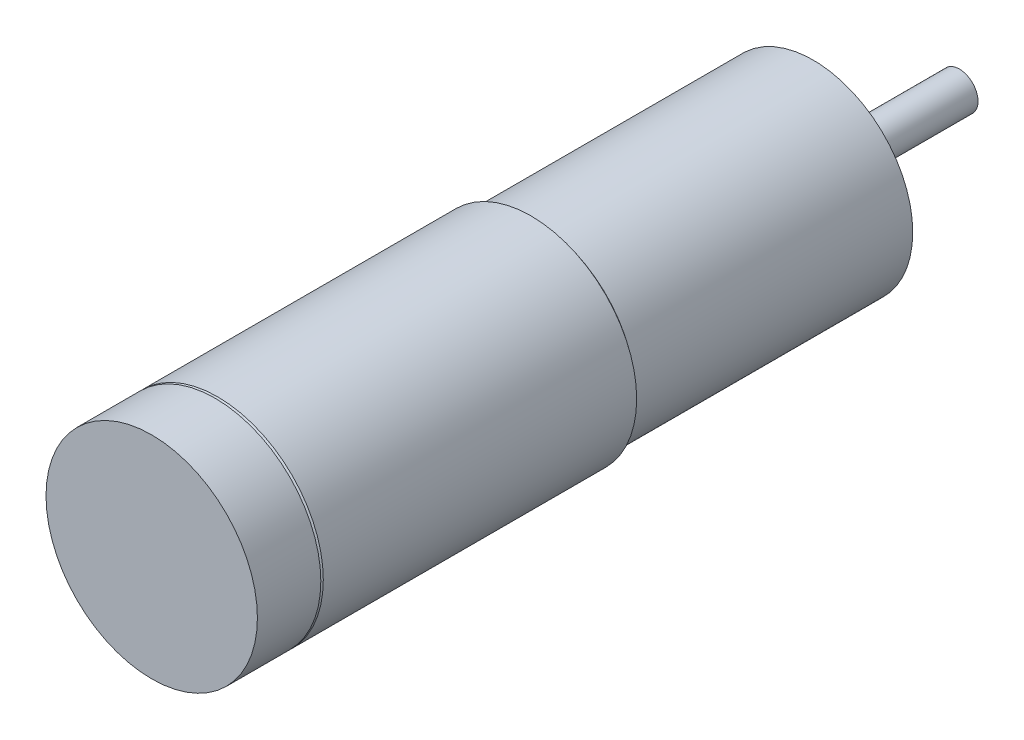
ISO-10303-21;
HEADER;
FILE_DESCRIPTION(('STEP AP214'),'2;1');
FILE_NAME('part.step','',(''),(''),'','','');
FILE_SCHEMA(('AUTOMOTIVE_DESIGN { 1 0 10303 214 1 1 1 1 }'));
ENDSEC;
DATA;
#1=APPLICATION_CONTEXT('core data for automotive mechanical design processes');
#2=APPLICATION_PROTOCOL_DEFINITION('international standard','automotive_design',2000,#1);
#3=PRODUCT_CONTEXT('',#1,'mechanical');
#4=PRODUCT('Part','Part','',(#3));
#5=PRODUCT_RELATED_PRODUCT_CATEGORY('part','',(#4));
#6=PRODUCT_DEFINITION_FORMATION('','',#4);
#7=PRODUCT_DEFINITION_CONTEXT('part definition',#1,'design');
#8=PRODUCT_DEFINITION('design','',#6,#7);
#9=PRODUCT_DEFINITION_SHAPE('','',#8);
#10=(LENGTH_UNIT() NAMED_UNIT(*) SI_UNIT(.MILLI.,.METRE.));
#11=(NAMED_UNIT(*) PLANE_ANGLE_UNIT() SI_UNIT($,.RADIAN.));
#12=(NAMED_UNIT(*) SI_UNIT($,.STERADIAN.) SOLID_ANGLE_UNIT());
#13=UNCERTAINTY_MEASURE_WITH_UNIT(LENGTH_MEASURE(1.E-05),#10,'distance_accuracy_value','');
#14=(GEOMETRIC_REPRESENTATION_CONTEXT(3) GLOBAL_UNCERTAINTY_ASSIGNED_CONTEXT((#13)) GLOBAL_UNIT_ASSIGNED_CONTEXT((#10,
#11,#12)) REPRESENTATION_CONTEXT('',''));
#15=CARTESIAN_POINT('',(0.,0.,0.));
#16=DIRECTION('',(0.,0.,1.));
#17=DIRECTION('',(1.,0.,0.));
#18=AXIS2_PLACEMENT_3D('',#15,#16,#17);
#19=CARTESIAN_POINT('',(0.,0.,-2.6));
#20=DIRECTION('',(0.,0.,-1.));
#21=DIRECTION('',(-1.,0.,0.));
#22=AXIS2_PLACEMENT_3D('',#19,#20,#21);
#23=PLANE('',#22);
#24=CARTESIAN_POINT('',(0.,0.,-2.6));
#25=DIRECTION('',(0.,0.,-1.));
#26=DIRECTION('',(-1.,0.,0.));
#27=AXIS2_PLACEMENT_3D('',#24,#25,#26);
#28=CIRCLE('',#27,3.);
#29=CARTESIAN_POINT('',(-3.,0.,-2.6));
#30=VERTEX_POINT('',#29);
#31=EDGE_CURVE('E78',#30,#30,#28,.T.);
#32=ORIENTED_EDGE('',*,*,#31,.T.);
#33=EDGE_LOOP('',(#32));
#34=FACE_BOUND('',#33,.T.);
#35=CARTESIAN_POINT('',(0.,0.,-2.6));
#36=DIRECTION('',(0.,0.,-1.));
#37=DIRECTION('',(-1.,0.,0.));
#38=AXIS2_PLACEMENT_3D('',#35,#36,#37);
#39=CIRCLE('',#38,1.5);
#40=CARTESIAN_POINT('',(-1.5,0.,-2.6));
#41=VERTEX_POINT('',#40);
#42=EDGE_CURVE('E77',#41,#41,#39,.F.);
#43=ORIENTED_EDGE('',*,*,#42,.T.);
#44=EDGE_LOOP('',(#43));
#45=FACE_BOUND('',#44,.T.);
#46=ADVANCED_FACE('F34',(#34,#45),#23,.T.);
#47=CARTESIAN_POINT('',(0.,0.,0.));
#48=DIRECTION('',(0.,0.,1.));
#49=DIRECTION('',(1.,0.,0.));
#50=AXIS2_PLACEMENT_3D('',#47,#48,#49);
#51=PLANE('',#50);
#52=CARTESIAN_POINT('',(0.,5.,0.));
#53=DIRECTION('',(0.,0.,-1.));
#54=DIRECTION('',(-1.,0.,0.));
#55=AXIS2_PLACEMENT_3D('',#52,#53,#54);
#56=CIRCLE('',#55,0.79999999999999);
#57=CARTESIAN_POINT('',(-0.79999999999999,5.,0.));
#58=VERTEX_POINT('',#57);
#59=EDGE_CURVE('E57',#58,#58,#56,.T.);
#60=ORIENTED_EDGE('',*,*,#59,.F.);
#61=EDGE_LOOP('',(#60));
#62=FACE_BOUND('',#61,.T.);
#63=CARTESIAN_POINT('',(0.,-5.,0.));
#64=DIRECTION('',(0.,0.,-1.));
#65=DIRECTION('',(-1.,0.,0.));
#66=AXIS2_PLACEMENT_3D('',#63,#64,#65);
#67=CIRCLE('',#66,0.79999999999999);
#68=CARTESIAN_POINT('',(-0.79999999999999,-5.,0.));
#69=VERTEX_POINT('',#68);
#70=EDGE_CURVE('E65',#69,#69,#67,.T.);
#71=ORIENTED_EDGE('',*,*,#70,.F.);
#72=EDGE_LOOP('',(#71));
#73=FACE_BOUND('',#72,.T.);
#74=CARTESIAN_POINT('',(0.,0.,0.));
#75=DIRECTION('',(0.,0.,1.));
#76=DIRECTION('',(1.,0.,0.));
#77=AXIS2_PLACEMENT_3D('',#74,#75,#76);
#78=CIRCLE('',#77,8.);
#79=CARTESIAN_POINT('',(8.,0.,0.));
#80=VERTEX_POINT('',#79);
#81=EDGE_CURVE('E84',#80,#80,#78,.T.);
#82=ORIENTED_EDGE('',*,*,#81,.F.);
#83=EDGE_LOOP('',(#82));
#84=FACE_BOUND('',#83,.T.);
#85=CARTESIAN_POINT('',(0.,0.,0.));
#86=DIRECTION('',(0.,0.,1.));
#87=DIRECTION('',(1.,0.,0.));
#88=AXIS2_PLACEMENT_3D('',#85,#86,#87);
#89=CIRCLE('',#88,3.);
#90=CARTESIAN_POINT('',(3.,0.,0.));
#91=VERTEX_POINT('',#90);
#92=EDGE_CURVE('E93',#91,#91,#89,.F.);
#93=ORIENTED_EDGE('',*,*,#92,.F.);
#94=EDGE_LOOP('',(#93));
#95=FACE_BOUND('',#94,.T.);
#96=ADVANCED_FACE('F121',(#62,#73,#84,#95),#51,.F.);
#97=CARTESIAN_POINT('',(0.,0.,22.7));
#98=DIRECTION('',(0.,0.,-1.));
#99=DIRECTION('',(-1.,0.,0.));
#100=AXIS2_PLACEMENT_3D('',#97,#98,#99);
#101=CYLINDRICAL_SURFACE('',#100,8.);
#102=CARTESIAN_POINT('',(0.,0.,22.319));
#103=DIRECTION('',(0.,0.,1.));
#104=DIRECTION('',(1.,0.,0.));
#105=AXIS2_PLACEMENT_3D('',#102,#103,#104);
#106=CIRCLE('',#105,8.);
#107=CARTESIAN_POINT('',(8.,0.,22.319));
#108=VERTEX_POINT('',#107);
#109=EDGE_CURVE('E90',#108,#108,#106,.F.);
#110=ORIENTED_EDGE('',*,*,#109,.T.);
#111=EDGE_LOOP('',(#110));
#112=FACE_BOUND('',#111,.T.);
#113=ORIENTED_EDGE('',*,*,#81,.T.);
#114=EDGE_LOOP('',(#113));
#115=FACE_BOUND('',#114,.T.);
#116=ADVANCED_FACE('F36',(#112,#115),#101,.T.);
#117=CARTESIAN_POINT('',(0.,0.,22.7));
#118=DIRECTION('',(0.,0.,-1.));
#119=DIRECTION('',(-1.,0.,0.));
#120=AXIS2_PLACEMENT_3D('',#117,#118,#119);
#121=CONICAL_SURFACE('',#120,7.619,0.785398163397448);
#122=ORIENTED_EDGE('',*,*,#109,.F.);
#123=EDGE_LOOP('',(#122));
#124=FACE_BOUND('',#123,.T.);
#125=CARTESIAN_POINT('',(0.,0.,22.7));
#126=DIRECTION('',(0.,0.,1.));
#127=DIRECTION('',(1.,0.,0.));
#128=AXIS2_PLACEMENT_3D('',#125,#126,#127);
#129=CIRCLE('',#128,7.619);
#130=CARTESIAN_POINT('',(7.619,0.,22.7));
#131=VERTEX_POINT('',#130);
#132=EDGE_CURVE('E87',#131,#131,#129,.T.);
#133=ORIENTED_EDGE('',*,*,#132,.F.);
#134=EDGE_LOOP('',(#133));
#135=FACE_BOUND('',#134,.T.);
#136=ADVANCED_FACE('F142',(#124,#135),#121,.T.);
#137=CARTESIAN_POINT('',(0.,0.,48.1));
#138=DIRECTION('',(0.,0.,-1.));
#139=DIRECTION('',(-1.,0.,0.));
#140=AXIS2_PLACEMENT_3D('',#137,#138,#139);
#141=CYLINDRICAL_SURFACE('',#140,8.5);
#142=CARTESIAN_POINT('',(0.,0.,47.9));
#143=DIRECTION('',(0.,0.,1.));
#144=DIRECTION('',(1.,0.,0.));
#145=AXIS2_PLACEMENT_3D('',#142,#143,#144);
#146=CIRCLE('',#145,8.5);
#147=CARTESIAN_POINT('',(8.5,0.,47.9));
#148=VERTEX_POINT('',#147);
#149=EDGE_CURVE('E11',#148,#148,#146,.F.);
#150=ORIENTED_EDGE('',*,*,#149,.T.);
#151=EDGE_LOOP('',(#150));
#152=FACE_BOUND('',#151,.T.);
#153=CARTESIAN_POINT('',(0.,0.,22.7));
#154=DIRECTION('',(0.,0.,1.));
#155=DIRECTION('',(1.,0.,0.));
#156=AXIS2_PLACEMENT_3D('',#153,#154,#155);
#157=CIRCLE('',#156,8.5);
#158=CARTESIAN_POINT('',(8.5,0.,22.7));
#159=VERTEX_POINT('',#158);
#160=EDGE_CURVE('E81',#159,#159,#157,.T.);
#161=ORIENTED_EDGE('',*,*,#160,.T.);
#162=EDGE_LOOP('',(#161));
#163=FACE_BOUND('',#162,.T.);
#164=ADVANCED_FACE('F138',(#152,#163),#141,.T.);
#165=CARTESIAN_POINT('',(0.,0.,22.7));
#166=DIRECTION('',(0.,0.,1.));
#167=DIRECTION('',(1.,0.,0.));
#168=AXIS2_PLACEMENT_3D('',#165,#166,#167);
#169=PLANE('',#168);
#170=ORIENTED_EDGE('',*,*,#132,.T.);
#171=EDGE_LOOP('',(#170));
#172=FACE_BOUND('',#171,.T.);
#173=ORIENTED_EDGE('',*,*,#160,.F.);
#174=EDGE_LOOP('',(#173));
#175=FACE_BOUND('',#174,.T.);
#176=ADVANCED_FACE('F134',(#172,#175),#169,.F.);
#177=CARTESIAN_POINT('',(0.,0.,-2.6));
#178=DIRECTION('',(0.,0.,1.));
#179=DIRECTION('',(1.,0.,0.));
#180=AXIS2_PLACEMENT_3D('',#177,#178,#179);
#181=CYLINDRICAL_SURFACE('',#180,3.);
#182=ORIENTED_EDGE('',*,*,#31,.F.);
#183=EDGE_LOOP('',(#182));
#184=FACE_BOUND('',#183,.T.);
#185=ORIENTED_EDGE('',*,*,#92,.T.);
#186=EDGE_LOOP('',(#185));
#187=FACE_BOUND('',#186,.T.);
#188=ADVANCED_FACE('F131',(#184,#187),#181,.T.);
#189=CARTESIAN_POINT('',(0.,0.,-11.75));
#190=DIRECTION('',(0.,0.,1.));
#191=DIRECTION('',(1.,0.,0.));
#192=AXIS2_PLACEMENT_3D('',#189,#190,#191);
#193=CYLINDRICAL_SURFACE('',#192,1.5);
#194=ORIENTED_EDGE('',*,*,#42,.F.);
#195=EDGE_LOOP('',(#194));
#196=FACE_BOUND('',#195,.T.);
#197=CARTESIAN_POINT('',(0.,0.,-11.75));
#198=DIRECTION('',(0.,0.,-1.));
#199=DIRECTION('',(-1.,0.,0.));
#200=AXIS2_PLACEMENT_3D('',#197,#198,#199);
#201=CIRCLE('',#200,1.5);
#202=CARTESIAN_POINT('',(-1.5,0.,-11.75));
#203=VERTEX_POINT('',#202);
#204=EDGE_CURVE('E74',#203,#203,#201,.T.);
#205=ORIENTED_EDGE('',*,*,#204,.F.);
#206=EDGE_LOOP('',(#205));
#207=FACE_BOUND('',#206,.T.);
#208=ADVANCED_FACE('F116',(#196,#207),#193,.T.);
#209=CARTESIAN_POINT('',(0.,0.,-11.75));
#210=DIRECTION('',(0.,0.,-1.));
#211=DIRECTION('',(-1.,0.,0.));
#212=AXIS2_PLACEMENT_3D('',#209,#210,#211);
#213=PLANE('',#212);
#214=ORIENTED_EDGE('',*,*,#204,.T.);
#215=EDGE_LOOP('',(#214));
#216=FACE_BOUND('',#215,.T.);
#217=ADVANCED_FACE('F106',(#216),#213,.T.);
#218=CARTESIAN_POINT('',(0.,0.,48.1));
#219=DIRECTION('',(0.,0.,-1.));
#220=DIRECTION('',(-1.,0.,0.));
#221=AXIS2_PLACEMENT_3D('',#218,#219,#220);
#222=CONICAL_SURFACE('',#221,8.3,0.785398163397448);
#223=ORIENTED_EDGE('',*,*,#149,.F.);
#224=EDGE_LOOP('',(#223));
#225=FACE_BOUND('',#224,.T.);
#226=CARTESIAN_POINT('',(0.,0.,48.1));
#227=DIRECTION('',(0.,0.,1.));
#228=DIRECTION('',(1.,0.,0.));
#229=AXIS2_PLACEMENT_3D('',#226,#227,#228);
#230=CIRCLE('',#229,8.3);
#231=CARTESIAN_POINT('',(8.3,0.,48.1));
#232=VERTEX_POINT('',#231);
#233=EDGE_CURVE('E42',#232,#232,#230,.T.);
#234=ORIENTED_EDGE('',*,*,#233,.F.);
#235=EDGE_LOOP('',(#234));
#236=FACE_BOUND('',#235,.T.);
#237=ADVANCED_FACE('F103',(#225,#236),#222,.T.);
#238=CARTESIAN_POINT('',(0.,0.,53.2));
#239=DIRECTION('',(0.,0.,-1.));
#240=DIRECTION('',(-1.,0.,0.));
#241=AXIS2_PLACEMENT_3D('',#238,#239,#240);
#242=CYLINDRICAL_SURFACE('',#241,8.5);
#243=CARTESIAN_POINT('',(0.,0.,53.2));
#244=DIRECTION('',(0.,0.,1.));
#245=DIRECTION('',(1.,0.,0.));
#246=AXIS2_PLACEMENT_3D('',#243,#244,#245);
#247=CIRCLE('',#246,8.5);
#248=CARTESIAN_POINT('',(8.5,0.,53.2));
#249=VERTEX_POINT('',#248);
#250=EDGE_CURVE('E71',#249,#249,#247,.T.);
#251=ORIENTED_EDGE('',*,*,#250,.F.);
#252=EDGE_LOOP('',(#251));
#253=FACE_BOUND('',#252,.T.);
#254=CARTESIAN_POINT('',(0.,0.,48.1));
#255=DIRECTION('',(0.,0.,1.));
#256=DIRECTION('',(1.,0.,0.));
#257=AXIS2_PLACEMENT_3D('',#254,#255,#256);
#258=CIRCLE('',#257,8.5);
#259=CARTESIAN_POINT('',(8.5,0.,48.1));
#260=VERTEX_POINT('',#259);
#261=EDGE_CURVE('E68',#260,#260,#258,.T.);
#262=ORIENTED_EDGE('',*,*,#261,.T.);
#263=EDGE_LOOP('',(#262));
#264=FACE_BOUND('',#263,.T.);
#265=ADVANCED_FACE('F105',(#253,#264),#242,.T.);
#266=CARTESIAN_POINT('',(0.,0.,53.2));
#267=DIRECTION('',(0.,0.,1.));
#268=DIRECTION('',(1.,0.,0.));
#269=AXIS2_PLACEMENT_3D('',#266,#267,#268);
#270=PLANE('',#269);
#271=ORIENTED_EDGE('',*,*,#250,.T.);
#272=EDGE_LOOP('',(#271));
#273=FACE_BOUND('',#272,.T.);
#274=ADVANCED_FACE('F113',(#273),#270,.T.);
#275=CARTESIAN_POINT('',(0.,0.,48.1));
#276=DIRECTION('',(0.,0.,1.));
#277=DIRECTION('',(1.,0.,0.));
#278=AXIS2_PLACEMENT_3D('',#275,#276,#277);
#279=PLANE('',#278);
#280=ORIENTED_EDGE('',*,*,#233,.T.);
#281=EDGE_LOOP('',(#280));
#282=FACE_BOUND('',#281,.T.);
#283=ORIENTED_EDGE('',*,*,#261,.F.);
#284=EDGE_LOOP('',(#283));
#285=FACE_BOUND('',#284,.T.);
#286=ADVANCED_FACE('F100',(#282,#285),#279,.F.);
#287=CARTESIAN_POINT('',(0.,-5.,0.));
#288=DIRECTION('',(0.,0.,-1.));
#289=DIRECTION('',(-1.,0.,0.));
#290=AXIS2_PLACEMENT_3D('',#287,#288,#289);
#291=CYLINDRICAL_SURFACE('',#290,0.799999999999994);
#292=CARTESIAN_POINT('',(0.,-5.,5.2));
#293=DIRECTION('',(0.,0.,-1.));
#294=DIRECTION('',(-1.,0.,0.));
#295=AXIS2_PLACEMENT_3D('',#292,#293,#294);
#296=CIRCLE('',#295,0.799999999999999);
#297=CARTESIAN_POINT('',(-0.799999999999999,-5.,5.2));
#298=VERTEX_POINT('',#297);
#299=EDGE_CURVE('E60',#298,#298,#296,.T.);
#300=ORIENTED_EDGE('',*,*,#299,.F.);
#301=EDGE_LOOP('',(#300));
#302=FACE_BOUND('',#301,.T.);
#303=ORIENTED_EDGE('',*,*,#70,.T.);
#304=EDGE_LOOP('',(#303));
#305=FACE_BOUND('',#304,.T.);
#306=ADVANCED_FACE('F180',(#302,#305),#291,.F.);
#307=CARTESIAN_POINT('',(0.,-5.,5.2));
#308=DIRECTION('',(0.,0.,-1.));
#309=DIRECTION('',(-1.,0.,0.));
#310=AXIS2_PLACEMENT_3D('',#307,#308,#309);
#311=CONICAL_SURFACE('',#310,0.799999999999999,1.02974425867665);
#312=CARTESIAN_POINT('',(0.,-5.,5.68068849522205));
#313=VERTEX_POINT('',#312);
#314=VERTEX_LOOP('',#313);
#315=FACE_BOUND('',#314,.T.);
#316=ORIENTED_EDGE('',*,*,#299,.T.);
#317=EDGE_LOOP('',(#316));
#318=FACE_BOUND('',#317,.T.);
#319=ADVANCED_FACE('F186',(#315,#318),#311,.F.);
#320=CARTESIAN_POINT('',(0.,5.,0.));
#321=DIRECTION('',(0.,0.,-1.));
#322=DIRECTION('',(-1.,0.,0.));
#323=AXIS2_PLACEMENT_3D('',#320,#321,#322);
#324=CYLINDRICAL_SURFACE('',#323,0.799999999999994);
#325=CARTESIAN_POINT('',(0.,5.,5.2));
#326=DIRECTION('',(0.,0.,-1.));
#327=DIRECTION('',(-1.,0.,0.));
#328=AXIS2_PLACEMENT_3D('',#325,#326,#327);
#329=CIRCLE('',#328,0.799999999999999);
#330=CARTESIAN_POINT('',(-0.799999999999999,5.,5.2));
#331=VERTEX_POINT('',#330);
#332=EDGE_CURVE('E55',#331,#331,#329,.T.);
#333=ORIENTED_EDGE('',*,*,#332,.F.);
#334=EDGE_LOOP('',(#333));
#335=FACE_BOUND('',#334,.T.);
#336=ORIENTED_EDGE('',*,*,#59,.T.);
#337=EDGE_LOOP('',(#336));
#338=FACE_BOUND('',#337,.T.);
#339=ADVANCED_FACE('F51',(#335,#338),#324,.F.);
#340=CARTESIAN_POINT('',(0.,5.,5.2));
#341=DIRECTION('',(0.,0.,-1.));
#342=DIRECTION('',(-1.,0.,0.));
#343=AXIS2_PLACEMENT_3D('',#340,#341,#342);
#344=CONICAL_SURFACE('',#343,0.799999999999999,1.02974425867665);
#345=CARTESIAN_POINT('',(0.,5.,5.68068849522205));
#346=VERTEX_POINT('',#345);
#347=VERTEX_LOOP('',#346);
#348=FACE_BOUND('',#347,.T.);
#349=ORIENTED_EDGE('',*,*,#332,.T.);
#350=EDGE_LOOP('',(#349));
#351=FACE_BOUND('',#350,.T.);
#352=ADVANCED_FACE('F48',(#348,#351),#344,.F.);
#353=CLOSED_SHELL('',(#46,#96,#116,#136,#164,#176,#188,#208,#217,#237,#265,#274,#286,#306,#319,
#339,#352));
#354=MANIFOLD_SOLID_BREP('B2',#353);
#355=ADVANCED_BREP_SHAPE_REPRESENTATION('',(#18,#354),#14);
#356=SHAPE_DEFINITION_REPRESENTATION(#9,#355);
ENDSEC;
END-ISO-10303-21;
